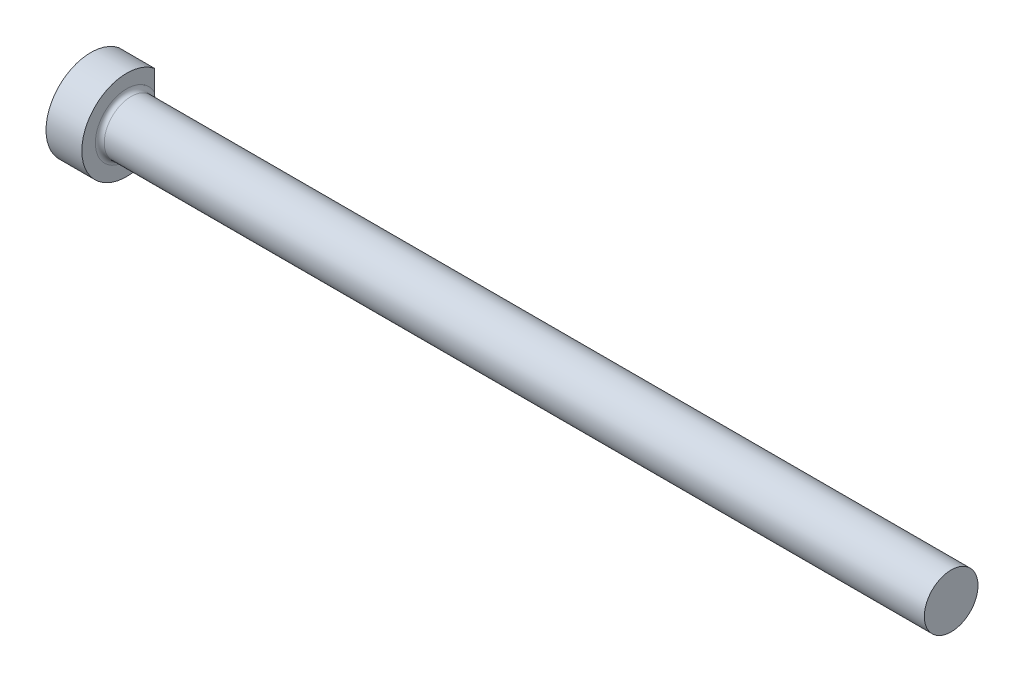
from build123d import *


with BuildPart() as part:
    # Sketch1 → PIN (revolve)
    with BuildSketch(Plane.XY, mode=Mode.PRIVATE) as pin_sk:
        with BuildLine():
            Line((0, 0), (0, 7.9375))
            Line((0, 7.9375), (6.35, 7.9375))
            Line((6.35, 7.9375), (6.35, 5.54355))
            ThreePointArc((6.35, 5.54355), (6.58062412, 4.98677412), (7.1374, 4.75615))
            Line((7.1374, 4.75615), (152.4, 4.75615))
            Line((152.4, 4.75615), (152.4, 0))
            Line((152.4, 0), (0, 0))
        make_face()
    revolve(pin_sk.sketch.rotate(Axis((152.4, 0, 0), (-1, 0, 0)), 180), axis=Axis((152.4, 0, 0), (-1, 0, 0)))

    # SurfaceCut1
    split(bisect_by=Plane(origin=(0, 0, -4.93395), x_dir=(-1, 0, 0), z_dir=(0, 0, -1)), keep=Keep.BOTTOM)


solid = part.part
